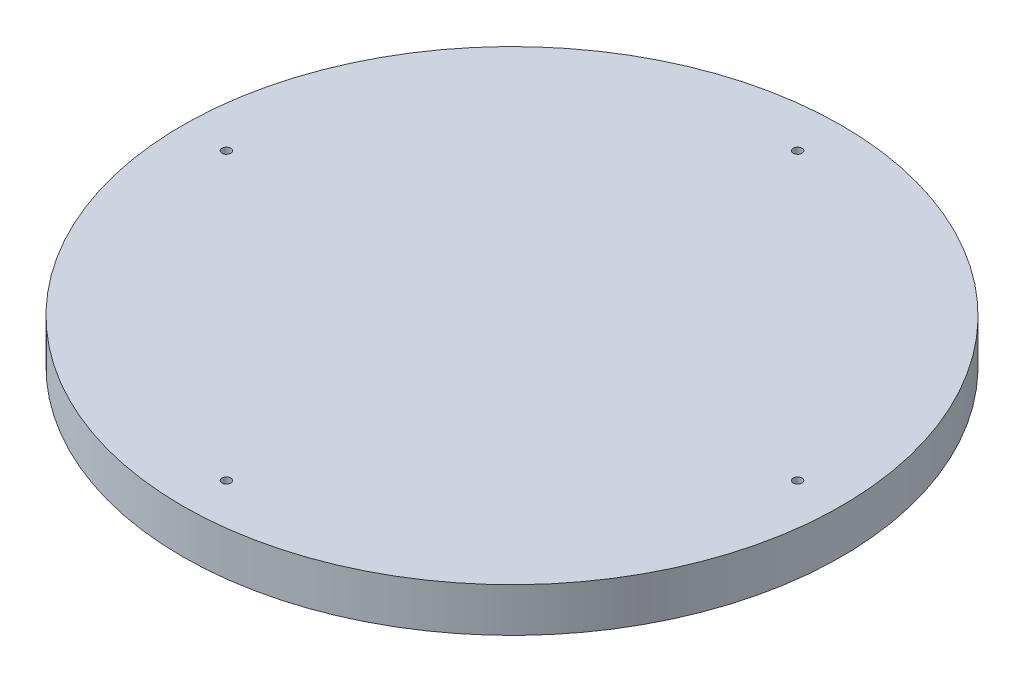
from build123d import *

# Parameters (mm, degrees)
SKETCH3_R           = 37.5
BOSS_EXTRUDE1_DEPTH = 5
SKETCH3_4_R         = 0.5
CUT_EXTRUDE1_DEPTH  = 54.268189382


with BuildPart() as part:
    # Sketch3 → Boss-Extrude1 (new body)
    with BuildSketch(Plane(origin=(0, 0, 0), x_dir=(1, 0, 0), z_dir=(0, 1, 0))):
        with Locations(Location((0, 0, 0), (0, 0, 270))):
            Circle(SKETCH3_R)
    extrude(amount=BOSS_EXTRUDE1_DEPTH)

    # Sketch3_4 → Cut-Extrude1 (cut, through all)
    with BuildSketch(Plane(origin=(0, 0, 0), x_dir=(1, 0, 0), z_dir=(0, 1, 0))):
        with Locations(Location((0, 32.5, 0), (0, 0, 270))):
            Circle(SKETCH3_4_R)
        with Locations(Location((-32.5, 0, 0), (0, 0, 270))):
            Circle(SKETCH3_4_R)
        with Locations(Location((32.5, 0, 0), (0, 0, 270))):
            Circle(SKETCH3_4_R)
        with Locations(Location((0, -32.5, 0), (0, 0, 270))):
            Circle(SKETCH3_4_R)
    extrude(amount=CUT_EXTRUDE1_DEPTH, mode=Mode.SUBTRACT)


solid = part.part
